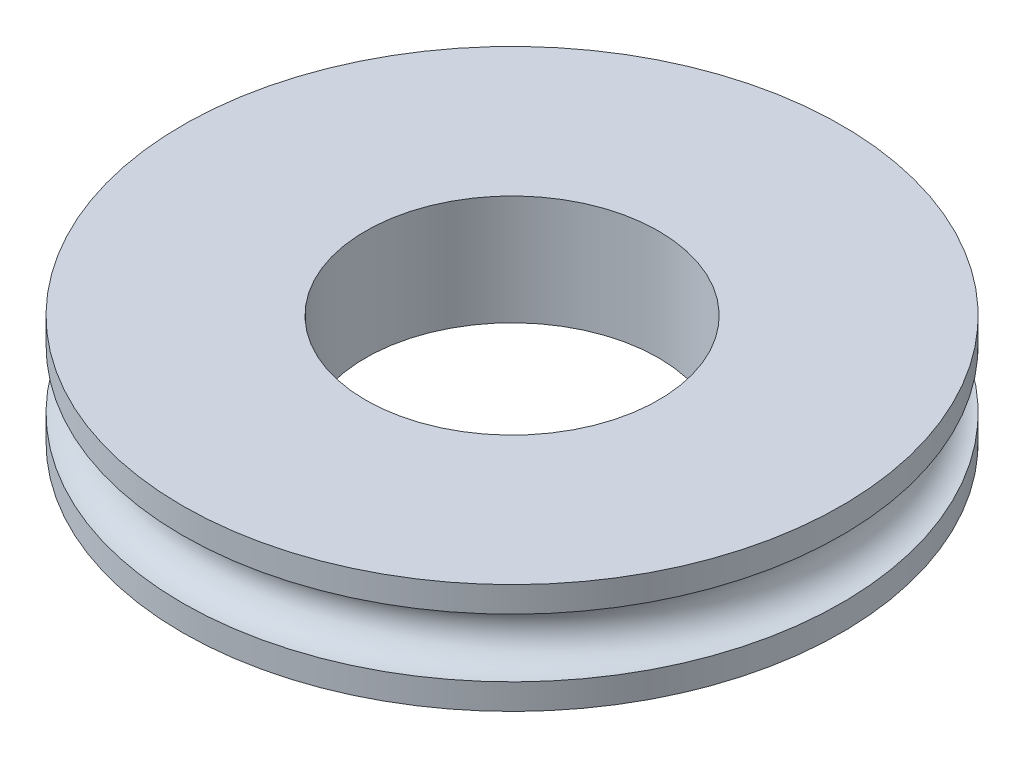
ISO-10303-21;
HEADER;
FILE_DESCRIPTION(('STEP AP214'),'2;1');
FILE_NAME('part.step','',(''),(''),'','','');
FILE_SCHEMA(('AUTOMOTIVE_DESIGN { 1 0 10303 214 1 1 1 1 }'));
ENDSEC;
DATA;
#1=APPLICATION_CONTEXT('core data for automotive mechanical design processes');
#2=APPLICATION_PROTOCOL_DEFINITION('international standard','automotive_design',2000,#1);
#3=PRODUCT_CONTEXT('',#1,'mechanical');
#4=PRODUCT('Part','Part','',(#3));
#5=PRODUCT_RELATED_PRODUCT_CATEGORY('part','',(#4));
#6=PRODUCT_DEFINITION_FORMATION('','',#4);
#7=PRODUCT_DEFINITION_CONTEXT('part definition',#1,'design');
#8=PRODUCT_DEFINITION('design','',#6,#7);
#9=PRODUCT_DEFINITION_SHAPE('','',#8);
#10=(LENGTH_UNIT() NAMED_UNIT(*) SI_UNIT(.MILLI.,.METRE.));
#11=(NAMED_UNIT(*) PLANE_ANGLE_UNIT() SI_UNIT($,.RADIAN.));
#12=(NAMED_UNIT(*) SI_UNIT($,.STERADIAN.) SOLID_ANGLE_UNIT());
#13=UNCERTAINTY_MEASURE_WITH_UNIT(LENGTH_MEASURE(1.E-05),#10,'distance_accuracy_value','');
#14=(GEOMETRIC_REPRESENTATION_CONTEXT(3) GLOBAL_UNCERTAINTY_ASSIGNED_CONTEXT((#13)) GLOBAL_UNIT_ASSIGNED_CONTEXT((#10,
#11,#12)) REPRESENTATION_CONTEXT('',''));
#15=CARTESIAN_POINT('',(0.,0.,0.));
#16=DIRECTION('',(0.,0.,1.));
#17=DIRECTION('',(1.,0.,0.));
#18=AXIS2_PLACEMENT_3D('',#15,#16,#17);
#19=CARTESIAN_POINT('',(0.,27.4959150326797,0.));
#20=DIRECTION('',(0.,1.,0.));
#21=DIRECTION('',(0.,0.,1.));
#22=AXIS2_PLACEMENT_3D('',#19,#20,#21);
#23=CYLINDRICAL_SURFACE('',#22,12.7);
#24=CARTESIAN_POINT('',(0.,-4.7625,0.));
#25=DIRECTION('',(0.,1.,0.));
#26=DIRECTION('',(0.,0.,1.));
#27=AXIS2_PLACEMENT_3D('',#24,#25,#26);
#28=CIRCLE('',#27,12.7);
#29=CARTESIAN_POINT('',(0.,-4.7625,12.7));
#30=VERTEX_POINT('',#29);
#31=EDGE_CURVE('E10',#30,#30,#28,.T.);
#32=ORIENTED_EDGE('',*,*,#31,.F.);
#33=EDGE_LOOP('',(#32));
#34=FACE_BOUND('',#33,.T.);
#35=CARTESIAN_POINT('',(0.,4.7625,0.));
#36=DIRECTION('',(0.,1.,0.));
#37=DIRECTION('',(0.,0.,1.));
#38=AXIS2_PLACEMENT_3D('',#35,#36,#37);
#39=CIRCLE('',#38,12.7);
#40=CARTESIAN_POINT('',(0.,4.7625,12.7));
#41=VERTEX_POINT('',#40);
#42=EDGE_CURVE('E55',#41,#41,#39,.T.);
#43=ORIENTED_EDGE('',*,*,#42,.T.);
#44=EDGE_LOOP('',(#43));
#45=FACE_BOUND('',#44,.T.);
#46=ADVANCED_FACE('F33',(#34,#45),#23,.F.);
#47=CARTESIAN_POINT('',(12.7,-4.7625,0.));
#48=DIRECTION('',(0.,1.,0.));
#49=DIRECTION('',(0.,0.,1.));
#50=AXIS2_PLACEMENT_3D('',#47,#48,#49);
#51=PLANE('',#50);
#52=CARTESIAN_POINT('',(0.,-4.7625,0.));
#53=DIRECTION('',(0.,1.,0.));
#54=DIRECTION('',(0.,0.,1.));
#55=AXIS2_PLACEMENT_3D('',#52,#53,#54);
#56=CIRCLE('',#55,28.575);
#57=CARTESIAN_POINT('',(0.,-4.7625,28.575));
#58=VERTEX_POINT('',#57);
#59=EDGE_CURVE('E39',#58,#58,#56,.T.);
#60=ORIENTED_EDGE('',*,*,#59,.F.);
#61=EDGE_LOOP('',(#60));
#62=FACE_BOUND('',#61,.T.);
#63=ORIENTED_EDGE('',*,*,#31,.T.);
#64=EDGE_LOOP('',(#63));
#65=FACE_BOUND('',#64,.T.);
#66=ADVANCED_FACE('F80',(#62,#65),#51,.F.);
#67=CARTESIAN_POINT('',(0.,27.4959150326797,0.));
#68=DIRECTION('',(0.,1.,0.));
#69=DIRECTION('',(0.,0.,1.));
#70=AXIS2_PLACEMENT_3D('',#67,#68,#69);
#71=CYLINDRICAL_SURFACE('',#70,28.575);
#72=CARTESIAN_POINT('',(0.,-2.54,0.));
#73=DIRECTION('',(0.,1.,0.));
#74=DIRECTION('',(0.,0.,1.));
#75=AXIS2_PLACEMENT_3D('',#72,#73,#74);
#76=CIRCLE('',#75,28.575);
#77=CARTESIAN_POINT('',(0.,-2.54,28.575));
#78=VERTEX_POINT('',#77);
#79=EDGE_CURVE('E43',#78,#78,#76,.T.);
#80=ORIENTED_EDGE('',*,*,#79,.F.);
#81=EDGE_LOOP('',(#80));
#82=FACE_BOUND('',#81,.T.);
#83=ORIENTED_EDGE('',*,*,#59,.T.);
#84=EDGE_LOOP('',(#83));
#85=FACE_BOUND('',#84,.T.);
#86=ADVANCED_FACE('F75',(#82,#85),#71,.T.);
#87=CARTESIAN_POINT('',(0.,0.,0.));
#88=DIRECTION('',(0.,1.,0.));
#89=DIRECTION('',(0.,0.,1.));
#90=AXIS2_PLACEMENT_3D('',#87,#88,#89);
#91=TOROIDAL_SURFACE('',#90,28.575,2.54);
#92=CARTESIAN_POINT('',(0.,2.54,0.));
#93=DIRECTION('',(0.,1.,0.));
#94=DIRECTION('',(0.,0.,1.));
#95=AXIS2_PLACEMENT_3D('',#92,#93,#94);
#96=CIRCLE('',#95,28.575);
#97=CARTESIAN_POINT('',(0.,2.54,28.575));
#98=VERTEX_POINT('',#97);
#99=EDGE_CURVE('E47',#98,#98,#96,.T.);
#100=ORIENTED_EDGE('',*,*,#99,.F.);
#101=EDGE_LOOP('',(#100));
#102=FACE_BOUND('',#101,.T.);
#103=ORIENTED_EDGE('',*,*,#79,.T.);
#104=EDGE_LOOP('',(#103));
#105=FACE_BOUND('',#104,.T.);
#106=ADVANCED_FACE('F69',(#102,#105),#91,.F.);
#107=CARTESIAN_POINT('',(0.,27.4959150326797,0.));
#108=DIRECTION('',(0.,1.,0.));
#109=DIRECTION('',(0.,0.,1.));
#110=AXIS2_PLACEMENT_3D('',#107,#108,#109);
#111=CYLINDRICAL_SURFACE('',#110,28.575);
#112=CARTESIAN_POINT('',(0.,4.7625,0.));
#113=DIRECTION('',(0.,1.,0.));
#114=DIRECTION('',(0.,0.,1.));
#115=AXIS2_PLACEMENT_3D('',#112,#113,#114);
#116=CIRCLE('',#115,28.575);
#117=CARTESIAN_POINT('',(0.,4.7625,28.575));
#118=VERTEX_POINT('',#117);
#119=EDGE_CURVE('E52',#118,#118,#116,.T.);
#120=ORIENTED_EDGE('',*,*,#119,.F.);
#121=EDGE_LOOP('',(#120));
#122=FACE_BOUND('',#121,.T.);
#123=ORIENTED_EDGE('',*,*,#99,.T.);
#124=EDGE_LOOP('',(#123));
#125=FACE_BOUND('',#124,.T.);
#126=ADVANCED_FACE('F63',(#122,#125),#111,.T.);
#127=CARTESIAN_POINT('',(12.7,4.7625,0.));
#128=DIRECTION('',(0.,-1.,0.));
#129=DIRECTION('',(0.,0.,-1.));
#130=AXIS2_PLACEMENT_3D('',#127,#128,#129);
#131=PLANE('',#130);
#132=ORIENTED_EDGE('',*,*,#42,.F.);
#133=EDGE_LOOP('',(#132));
#134=FACE_BOUND('',#133,.T.);
#135=ORIENTED_EDGE('',*,*,#119,.T.);
#136=EDGE_LOOP('',(#135));
#137=FACE_BOUND('',#136,.T.);
#138=ADVANCED_FACE('F60',(#134,#137),#131,.F.);
#139=CLOSED_SHELL('',(#46,#66,#86,#106,#126,#138));
#140=MANIFOLD_SOLID_BREP('B2',#139);
#141=ADVANCED_BREP_SHAPE_REPRESENTATION('',(#18,#140),#14);
#142=SHAPE_DEFINITION_REPRESENTATION(#9,#141);
ENDSEC;
END-ISO-10303-21;
